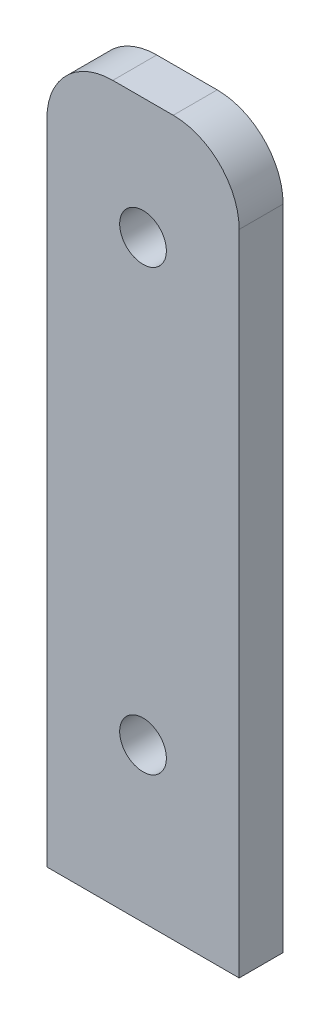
ISO-10303-21;
HEADER;
FILE_DESCRIPTION(('STEP AP214'),'2;1');
FILE_NAME('part.step','',(''),(''),'','','');
FILE_SCHEMA(('AUTOMOTIVE_DESIGN { 1 0 10303 214 1 1 1 1 }'));
ENDSEC;
DATA;
#1=APPLICATION_CONTEXT('core data for automotive mechanical design processes');
#2=APPLICATION_PROTOCOL_DEFINITION('international standard','automotive_design',2000,#1);
#3=PRODUCT_CONTEXT('',#1,'mechanical');
#4=PRODUCT('Part','Part','',(#3));
#5=PRODUCT_RELATED_PRODUCT_CATEGORY('part','',(#4));
#6=PRODUCT_DEFINITION_FORMATION('','',#4);
#7=PRODUCT_DEFINITION_CONTEXT('part definition',#1,'design');
#8=PRODUCT_DEFINITION('design','',#6,#7);
#9=PRODUCT_DEFINITION_SHAPE('','',#8);
#10=(LENGTH_UNIT() NAMED_UNIT(*) SI_UNIT(.MILLI.,.METRE.));
#11=(NAMED_UNIT(*) PLANE_ANGLE_UNIT() SI_UNIT($,.RADIAN.));
#12=(NAMED_UNIT(*) SI_UNIT($,.STERADIAN.) SOLID_ANGLE_UNIT());
#13=UNCERTAINTY_MEASURE_WITH_UNIT(LENGTH_MEASURE(1.E-05),#10,'distance_accuracy_value','');
#14=(GEOMETRIC_REPRESENTATION_CONTEXT(3) GLOBAL_UNCERTAINTY_ASSIGNED_CONTEXT((#13)) GLOBAL_UNIT_ASSIGNED_CONTEXT((#10,
#11,#12)) REPRESENTATION_CONTEXT('',''));
#15=CARTESIAN_POINT('',(0.,0.,0.));
#16=DIRECTION('',(0.,0.,1.));
#17=DIRECTION('',(1.,0.,0.));
#18=AXIS2_PLACEMENT_3D('',#15,#16,#17);
#19=CARTESIAN_POINT('',(-17.5,0.,4.));
#20=DIRECTION('',(1.,0.,0.));
#21=DIRECTION('',(0.,0.,-1.));
#22=AXIS2_PLACEMENT_3D('',#19,#20,#21);
#23=PLANE('',#22);
#24=DIRECTION('',(0.,-1.,0.));
#25=VECTOR('',#24,1.);
#26=CARTESIAN_POINT('',(-17.5,0.,4.));
#27=LINE('',#26,#25);
#28=CARTESIAN_POINT('',(-17.5,118.,4.));
#29=VERTEX_POINT('',#28);
#30=CARTESIAN_POINT('',(-17.5,0.,4.));
#31=VERTEX_POINT('',#30);
#32=EDGE_CURVE('E87',#29,#31,#27,.T.);
#33=ORIENTED_EDGE('',*,*,#32,.F.);
#34=DIRECTION('',(0.,0.,-1.));
#35=VECTOR('',#34,1.);
#36=CARTESIAN_POINT('',(-17.5,118.,4.));
#37=LINE('',#36,#35);
#38=CARTESIAN_POINT('',(-17.5,118.,-4.));
#39=VERTEX_POINT('',#38);
#40=EDGE_CURVE('E110',#29,#39,#37,.T.);
#41=ORIENTED_EDGE('',*,*,#40,.T.);
#42=DIRECTION('',(0.,-1.,0.));
#43=VECTOR('',#42,1.);
#44=CARTESIAN_POINT('',(-17.5,0.,-4.));
#45=LINE('',#44,#43);
#46=CARTESIAN_POINT('',(-17.5,0.,-4.));
#47=VERTEX_POINT('',#46);
#48=EDGE_CURVE('E108',#39,#47,#45,.T.);
#49=ORIENTED_EDGE('',*,*,#48,.T.);
#50=DIRECTION('',(0.,0.,-1.));
#51=VECTOR('',#50,1.);
#52=CARTESIAN_POINT('',(-17.5,0.,4.));
#53=LINE('',#52,#51);
#54=EDGE_CURVE('E102',#31,#47,#53,.T.);
#55=ORIENTED_EDGE('',*,*,#54,.F.);
#56=EDGE_LOOP('',(#33,#41,#49,#55));
#57=FACE_BOUND('',#56,.T.);
#58=ADVANCED_FACE('F33',(#57),#23,.F.);
#59=CARTESIAN_POINT('',(-17.5,0.,4.));
#60=DIRECTION('',(0.,1.,0.));
#61=DIRECTION('',(0.,0.,1.));
#62=AXIS2_PLACEMENT_3D('',#59,#60,#61);
#63=PLANE('',#62);
#64=DIRECTION('',(1.,0.,0.));
#65=VECTOR('',#64,1.);
#66=CARTESIAN_POINT('',(-17.5,0.,-4.));
#67=LINE('',#66,#65);
#68=CARTESIAN_POINT('',(17.5,0.,-4.));
#69=VERTEX_POINT('',#68);
#70=EDGE_CURVE('E137',#47,#69,#67,.T.);
#71=ORIENTED_EDGE('',*,*,#70,.T.);
#72=DIRECTION('',(0.,0.,-1.));
#73=VECTOR('',#72,1.);
#74=CARTESIAN_POINT('',(17.5,0.,4.));
#75=LINE('',#74,#73);
#76=CARTESIAN_POINT('',(17.5,0.,4.));
#77=VERTEX_POINT('',#76);
#78=EDGE_CURVE('E104',#77,#69,#75,.T.);
#79=ORIENTED_EDGE('',*,*,#78,.F.);
#80=DIRECTION('',(1.,0.,0.));
#81=VECTOR('',#80,1.);
#82=CARTESIAN_POINT('',(-17.5,0.,4.));
#83=LINE('',#82,#81);
#84=EDGE_CURVE('E90',#31,#77,#83,.T.);
#85=ORIENTED_EDGE('',*,*,#84,.F.);
#86=ORIENTED_EDGE('',*,*,#54,.T.);
#87=EDGE_LOOP('',(#71,#79,#85,#86));
#88=FACE_BOUND('',#87,.T.);
#89=ADVANCED_FACE('F101',(#88),#63,.F.);
#90=CARTESIAN_POINT('',(17.5,0.,4.));
#91=DIRECTION('',(-1.,0.,0.));
#92=DIRECTION('',(0.,0.,1.));
#93=AXIS2_PLACEMENT_3D('',#90,#91,#92);
#94=PLANE('',#93);
#95=DIRECTION('',(0.,1.,0.));
#96=VECTOR('',#95,1.);
#97=CARTESIAN_POINT('',(17.5,0.,-4.));
#98=LINE('',#97,#96);
#99=CARTESIAN_POINT('',(17.5,118.,-4.));
#100=VERTEX_POINT('',#99);
#101=EDGE_CURVE('E135',#69,#100,#98,.T.);
#102=ORIENTED_EDGE('',*,*,#101,.T.);
#103=DIRECTION('',(0.,0.,-1.));
#104=VECTOR('',#103,1.);
#105=CARTESIAN_POINT('',(17.5,118.,4.));
#106=LINE('',#105,#104);
#107=CARTESIAN_POINT('',(17.5,118.,4.));
#108=VERTEX_POINT('',#107);
#109=EDGE_CURVE('E11',#100,#108,#106,.F.);
#110=ORIENTED_EDGE('',*,*,#109,.T.);
#111=DIRECTION('',(0.,1.,0.));
#112=VECTOR('',#111,1.);
#113=CARTESIAN_POINT('',(17.5,0.,4.));
#114=LINE('',#113,#112);
#115=EDGE_CURVE('E105',#77,#108,#114,.T.);
#116=ORIENTED_EDGE('',*,*,#115,.F.);
#117=ORIENTED_EDGE('',*,*,#78,.T.);
#118=EDGE_LOOP('',(#102,#110,#116,#117));
#119=FACE_BOUND('',#118,.T.);
#120=ADVANCED_FACE('F136',(#119),#94,.F.);
#121=CARTESIAN_POINT('',(-17.5,130.,4.));
#122=DIRECTION('',(0.,-1.,0.));
#123=DIRECTION('',(0.,0.,-1.));
#124=AXIS2_PLACEMENT_3D('',#121,#122,#123);
#125=PLANE('',#124);
#126=DIRECTION('',(-1.,0.,0.));
#127=VECTOR('',#126,1.);
#128=CARTESIAN_POINT('',(-17.5,130.,-4.));
#129=LINE('',#128,#127);
#130=CARTESIAN_POINT('',(5.5,130.,-4.));
#131=VERTEX_POINT('',#130);
#132=CARTESIAN_POINT('',(-5.5,130.,-4.));
#133=VERTEX_POINT('',#132);
#134=EDGE_CURVE('E97',#131,#133,#129,.T.);
#135=ORIENTED_EDGE('',*,*,#134,.T.);
#136=DIRECTION('',(0.,0.,-1.));
#137=VECTOR('',#136,1.);
#138=CARTESIAN_POINT('',(-5.5,130.,4.));
#139=LINE('',#138,#137);
#140=CARTESIAN_POINT('',(-5.5,130.,4.));
#141=VERTEX_POINT('',#140);
#142=EDGE_CURVE('E54',#133,#141,#139,.F.);
#143=ORIENTED_EDGE('',*,*,#142,.T.);
#144=DIRECTION('',(-1.,0.,0.));
#145=VECTOR('',#144,1.);
#146=CARTESIAN_POINT('',(-17.5,130.,4.));
#147=LINE('',#146,#145);
#148=CARTESIAN_POINT('',(5.5,130.,4.));
#149=VERTEX_POINT('',#148);
#150=EDGE_CURVE('E114',#149,#141,#147,.T.);
#151=ORIENTED_EDGE('',*,*,#150,.F.);
#152=DIRECTION('',(0.,0.,-1.));
#153=VECTOR('',#152,1.);
#154=CARTESIAN_POINT('',(5.5,130.,4.));
#155=LINE('',#154,#153);
#156=EDGE_CURVE('E121',#149,#131,#155,.T.);
#157=ORIENTED_EDGE('',*,*,#156,.T.);
#158=EDGE_LOOP('',(#135,#143,#151,#157));
#159=FACE_BOUND('',#158,.T.);
#160=ADVANCED_FACE('F129',(#159),#125,.F.);
#161=CARTESIAN_POINT('',(-17.5,130.,4.));
#162=DIRECTION('',(0.,0.,-1.));
#163=DIRECTION('',(-1.,0.,0.));
#164=AXIS2_PLACEMENT_3D('',#161,#162,#163);
#165=PLANE('',#164);
#166=CARTESIAN_POINT('',(0.,28.,4.));
#167=DIRECTION('',(0.,0.,1.));
#168=DIRECTION('',(1.,0.,0.));
#169=AXIS2_PLACEMENT_3D('',#166,#167,#168);
#170=CIRCLE('',#169,4.24999999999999);
#171=CARTESIAN_POINT('',(4.24999999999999,28.,4.));
#172=VERTEX_POINT('',#171);
#173=EDGE_CURVE('E152',#172,#172,#170,.T.);
#174=ORIENTED_EDGE('',*,*,#173,.F.);
#175=EDGE_LOOP('',(#174));
#176=FACE_BOUND('',#175,.T.);
#177=CARTESIAN_POINT('',(0.,108.,4.));
#178=DIRECTION('',(0.,0.,1.));
#179=DIRECTION('',(1.,0.,0.));
#180=AXIS2_PLACEMENT_3D('',#177,#178,#179);
#181=CIRCLE('',#180,4.24999999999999);
#182=CARTESIAN_POINT('',(4.24999999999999,108.,4.));
#183=VERTEX_POINT('',#182);
#184=EDGE_CURVE('E146',#183,#183,#181,.T.);
#185=ORIENTED_EDGE('',*,*,#184,.F.);
#186=EDGE_LOOP('',(#185));
#187=FACE_BOUND('',#186,.T.);
#188=ORIENTED_EDGE('',*,*,#150,.T.);
#189=CARTESIAN_POINT('',(-5.5,118.,4.));
#190=DIRECTION('',(0.,0.,-1.));
#191=DIRECTION('',(-1.,0.,0.));
#192=AXIS2_PLACEMENT_3D('',#189,#190,#191);
#193=CIRCLE('',#192,12.);
#194=EDGE_CURVE('E41',#141,#29,#193,.F.);
#195=ORIENTED_EDGE('',*,*,#194,.T.);
#196=ORIENTED_EDGE('',*,*,#32,.T.);
#197=ORIENTED_EDGE('',*,*,#84,.T.);
#198=ORIENTED_EDGE('',*,*,#115,.T.);
#199=CARTESIAN_POINT('',(5.5,118.,4.));
#200=DIRECTION('',(0.,0.,-1.));
#201=DIRECTION('',(-1.,0.,0.));
#202=AXIS2_PLACEMENT_3D('',#199,#200,#201);
#203=CIRCLE('',#202,12.);
#204=EDGE_CURVE('E125',#108,#149,#203,.F.);
#205=ORIENTED_EDGE('',*,*,#204,.T.);
#206=EDGE_LOOP('',(#188,#195,#196,#197,#198,#205));
#207=FACE_BOUND('',#206,.T.);
#208=ADVANCED_FACE('F89',(#176,#187,#207),#165,.F.);
#209=CARTESIAN_POINT('',(-17.5,130.,-4.));
#210=DIRECTION('',(0.,0.,-1.));
#211=DIRECTION('',(-1.,0.,0.));
#212=AXIS2_PLACEMENT_3D('',#209,#210,#211);
#213=PLANE('',#212);
#214=CARTESIAN_POINT('',(0.,28.,-4.));
#215=DIRECTION('',(0.,0.,1.));
#216=DIRECTION('',(1.,0.,0.));
#217=AXIS2_PLACEMENT_3D('',#214,#215,#216);
#218=CIRCLE('',#217,4.25);
#219=CARTESIAN_POINT('',(4.25,28.,-4.));
#220=VERTEX_POINT('',#219);
#221=EDGE_CURVE('E149',#220,#220,#218,.T.);
#222=ORIENTED_EDGE('',*,*,#221,.T.);
#223=EDGE_LOOP('',(#222));
#224=FACE_BOUND('',#223,.T.);
#225=CARTESIAN_POINT('',(0.,108.,-4.));
#226=DIRECTION('',(0.,0.,1.));
#227=DIRECTION('',(1.,0.,0.));
#228=AXIS2_PLACEMENT_3D('',#225,#226,#227);
#229=CIRCLE('',#228,4.25);
#230=CARTESIAN_POINT('',(4.25,108.,-4.));
#231=VERTEX_POINT('',#230);
#232=EDGE_CURVE('E141',#231,#231,#229,.T.);
#233=ORIENTED_EDGE('',*,*,#232,.T.);
#234=EDGE_LOOP('',(#233));
#235=FACE_BOUND('',#234,.T.);
#236=ORIENTED_EDGE('',*,*,#48,.F.);
#237=CARTESIAN_POINT('',(-5.5,118.,-4.));
#238=DIRECTION('',(0.,0.,-1.));
#239=DIRECTION('',(-1.,0.,0.));
#240=AXIS2_PLACEMENT_3D('',#237,#238,#239);
#241=CIRCLE('',#240,12.);
#242=EDGE_CURVE('E119',#39,#133,#241,.T.);
#243=ORIENTED_EDGE('',*,*,#242,.T.);
#244=ORIENTED_EDGE('',*,*,#134,.F.);
#245=CARTESIAN_POINT('',(5.5,118.,-4.));
#246=DIRECTION('',(0.,0.,-1.));
#247=DIRECTION('',(-1.,0.,0.));
#248=AXIS2_PLACEMENT_3D('',#245,#246,#247);
#249=CIRCLE('',#248,12.);
#250=EDGE_CURVE('E112',#131,#100,#249,.T.);
#251=ORIENTED_EDGE('',*,*,#250,.T.);
#252=ORIENTED_EDGE('',*,*,#101,.F.);
#253=ORIENTED_EDGE('',*,*,#70,.F.);
#254=EDGE_LOOP('',(#236,#243,#244,#251,#252,#253));
#255=FACE_BOUND('',#254,.T.);
#256=ADVANCED_FACE('F134',(#224,#235,#255),#213,.T.);
#257=CARTESIAN_POINT('',(-5.5,118.,4.));
#258=DIRECTION('',(0.,0.,-1.));
#259=DIRECTION('',(-1.,0.,0.));
#260=AXIS2_PLACEMENT_3D('',#257,#258,#259);
#261=CYLINDRICAL_SURFACE('',#260,12.);
#262=ORIENTED_EDGE('',*,*,#194,.F.);
#263=ORIENTED_EDGE('',*,*,#142,.F.);
#264=ORIENTED_EDGE('',*,*,#242,.F.);
#265=ORIENTED_EDGE('',*,*,#40,.F.);
#266=EDGE_LOOP('',(#262,#263,#264,#265));
#267=FACE_BOUND('',#266,.T.);
#268=ADVANCED_FACE('F173',(#267),#261,.T.);
#269=CARTESIAN_POINT('',(5.5,118.,4.));
#270=DIRECTION('',(0.,0.,-1.));
#271=DIRECTION('',(-1.,0.,0.));
#272=AXIS2_PLACEMENT_3D('',#269,#270,#271);
#273=CYLINDRICAL_SURFACE('',#272,12.);
#274=ORIENTED_EDGE('',*,*,#204,.F.);
#275=ORIENTED_EDGE('',*,*,#109,.F.);
#276=ORIENTED_EDGE('',*,*,#250,.F.);
#277=ORIENTED_EDGE('',*,*,#156,.F.);
#278=EDGE_LOOP('',(#274,#275,#276,#277));
#279=FACE_BOUND('',#278,.T.);
#280=ADVANCED_FACE('F35',(#279),#273,.T.);
#281=CARTESIAN_POINT('',(0.,108.,4.));
#282=DIRECTION('',(0.,0.,1.));
#283=DIRECTION('',(1.,0.,0.));
#284=AXIS2_PLACEMENT_3D('',#281,#282,#283);
#285=CYLINDRICAL_SURFACE('',#284,4.24999999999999);
#286=ORIENTED_EDGE('',*,*,#232,.F.);
#287=EDGE_LOOP('',(#286));
#288=FACE_BOUND('',#287,.T.);
#289=ORIENTED_EDGE('',*,*,#184,.T.);
#290=EDGE_LOOP('',(#289));
#291=FACE_BOUND('',#290,.T.);
#292=ADVANCED_FACE('F163',(#288,#291),#285,.F.);
#293=CARTESIAN_POINT('',(0.,28.,4.));
#294=DIRECTION('',(0.,0.,1.));
#295=DIRECTION('',(1.,0.,0.));
#296=AXIS2_PLACEMENT_3D('',#293,#294,#295);
#297=CYLINDRICAL_SURFACE('',#296,4.24999999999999);
#298=ORIENTED_EDGE('',*,*,#221,.F.);
#299=EDGE_LOOP('',(#298));
#300=FACE_BOUND('',#299,.T.);
#301=ORIENTED_EDGE('',*,*,#173,.T.);
#302=EDGE_LOOP('',(#301));
#303=FACE_BOUND('',#302,.T.);
#304=ADVANCED_FACE('F156',(#300,#303),#297,.F.);
#305=CLOSED_SHELL('',(#58,#89,#120,#160,#208,#256,#268,#280,#292,#304));
#306=MANIFOLD_SOLID_BREP('B2',#305);
#307=ADVANCED_BREP_SHAPE_REPRESENTATION('',(#18,#306),#14);
#308=SHAPE_DEFINITION_REPRESENTATION(#9,#307);
ENDSEC;
END-ISO-10303-21;
